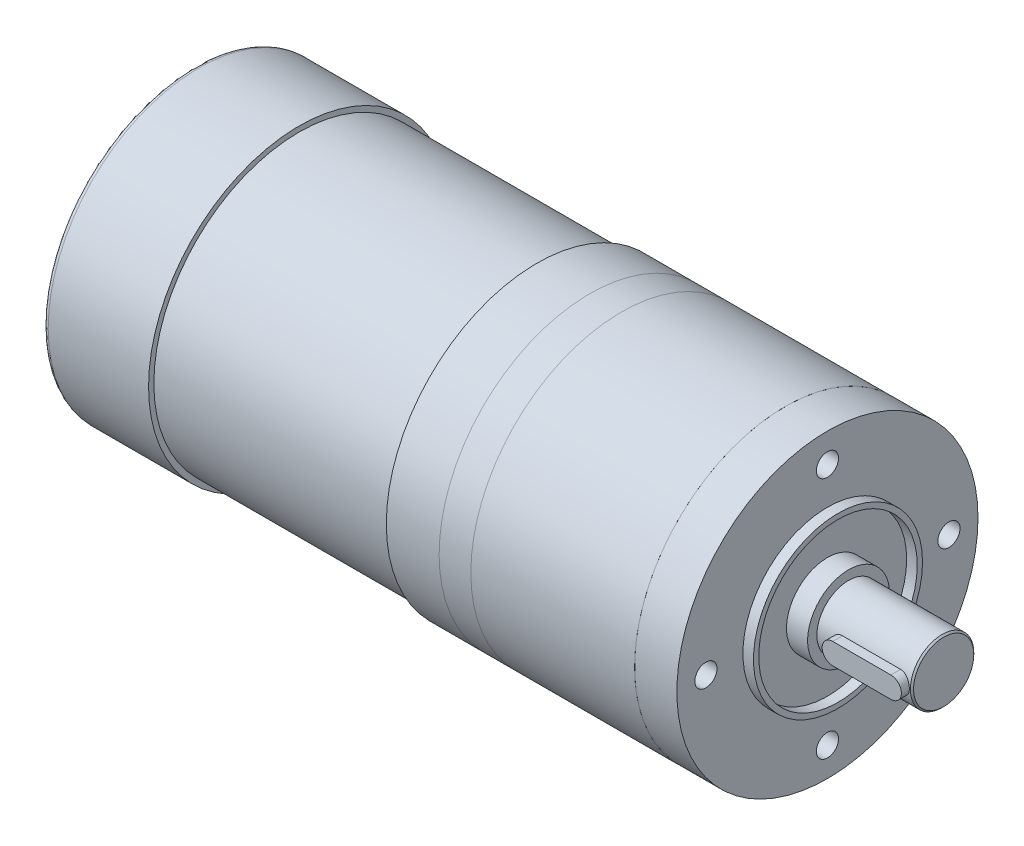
ISO-10303-21;
HEADER;
FILE_DESCRIPTION(('STEP AP214'),'2;1');
FILE_NAME('part.step','',(''),(''),'','','');
FILE_SCHEMA(('AUTOMOTIVE_DESIGN { 1 0 10303 214 1 1 1 1 }'));
ENDSEC;
DATA;
#1=APPLICATION_CONTEXT('core data for automotive mechanical design processes');
#2=APPLICATION_PROTOCOL_DEFINITION('international standard','automotive_design',2000,#1);
#3=PRODUCT_CONTEXT('',#1,'mechanical');
#4=PRODUCT('Part','Part','',(#3));
#5=PRODUCT_RELATED_PRODUCT_CATEGORY('part','',(#4));
#6=PRODUCT_DEFINITION_FORMATION('','',#4);
#7=PRODUCT_DEFINITION_CONTEXT('part definition',#1,'design');
#8=PRODUCT_DEFINITION('design','',#6,#7);
#9=PRODUCT_DEFINITION_SHAPE('','',#8);
#10=(LENGTH_UNIT() NAMED_UNIT(*) SI_UNIT(.MILLI.,.METRE.));
#11=(NAMED_UNIT(*) PLANE_ANGLE_UNIT() SI_UNIT($,.RADIAN.));
#12=(NAMED_UNIT(*) SI_UNIT($,.STERADIAN.) SOLID_ANGLE_UNIT());
#13=UNCERTAINTY_MEASURE_WITH_UNIT(LENGTH_MEASURE(1.E-05),#10,'distance_accuracy_value','');
#14=(GEOMETRIC_REPRESENTATION_CONTEXT(3) GLOBAL_UNCERTAINTY_ASSIGNED_CONTEXT((#13)) GLOBAL_UNIT_ASSIGNED_CONTEXT((#10,
#11,#12)) REPRESENTATION_CONTEXT('',''));
#15=CARTESIAN_POINT('',(0.,0.,0.));
#16=DIRECTION('',(0.,0.,1.));
#17=DIRECTION('',(1.,0.,0.));
#18=AXIS2_PLACEMENT_3D('',#15,#16,#17);
#19=CARTESIAN_POINT('',(8.5,0.,7.5));
#20=DIRECTION('',(0.,0.,-1.));
#21=DIRECTION('',(-1.,0.,0.));
#22=AXIS2_PLACEMENT_3D('',#19,#20,#21);
#23=CYLINDRICAL_SURFACE('',#22,2.);
#24=CARTESIAN_POINT('',(8.5,0.,3.5));
#25=DIRECTION('',(0.,0.,1.));
#26=DIRECTION('',(1.,0.,0.));
#27=AXIS2_PLACEMENT_3D('',#24,#25,#26);
#28=CIRCLE('',#27,2.);
#29=CARTESIAN_POINT('',(8.5,2.,3.5));
#30=VERTEX_POINT('',#29);
#31=CARTESIAN_POINT('',(8.5,-2.,3.5));
#32=VERTEX_POINT('',#31);
#33=EDGE_CURVE('E111',#30,#32,#28,.T.);
#34=ORIENTED_EDGE('',*,*,#33,.T.);
#35=DIRECTION('',(0.,0.,-1.));
#36=VECTOR('',#35,1.);
#37=CARTESIAN_POINT('',(8.5,-2.,7.5));
#38=LINE('',#37,#36);
#39=CARTESIAN_POINT('',(8.5,-2.,7.5));
#40=VERTEX_POINT('',#39);
#41=EDGE_CURVE('E12',#40,#32,#38,.T.);
#42=ORIENTED_EDGE('',*,*,#41,.F.);
#43=CARTESIAN_POINT('',(8.5,0.,7.5));
#44=DIRECTION('',(0.,0.,1.));
#45=DIRECTION('',(1.,0.,0.));
#46=AXIS2_PLACEMENT_3D('',#43,#44,#45);
#47=CIRCLE('',#46,2.);
#48=CARTESIAN_POINT('',(8.5,2.,7.5));
#49=VERTEX_POINT('',#48);
#50=EDGE_CURVE('E99',#49,#40,#47,.T.);
#51=ORIENTED_EDGE('',*,*,#50,.F.);
#52=DIRECTION('',(0.,0.,-1.));
#53=VECTOR('',#52,1.);
#54=CARTESIAN_POINT('',(8.5,2.,7.5));
#55=LINE('',#54,#53);
#56=EDGE_CURVE('E107',#49,#30,#55,.T.);
#57=ORIENTED_EDGE('',*,*,#56,.T.);
#58=EDGE_LOOP('',(#34,#42,#51,#57));
#59=FACE_BOUND('',#58,.T.);
#60=ADVANCED_FACE('F48',(#59),#23,.T.);
#61=CARTESIAN_POINT('',(19.5,-2.,7.5));
#62=DIRECTION('',(0.,1.,0.));
#63=DIRECTION('',(-1.,0.,0.));
#64=AXIS2_PLACEMENT_3D('',#61,#62,#63);
#65=PLANE('',#64);
#66=DIRECTION('',(1.,0.,0.));
#67=VECTOR('',#66,1.);
#68=CARTESIAN_POINT('',(19.5,-2.,3.5));
#69=LINE('',#68,#67);
#70=CARTESIAN_POINT('',(19.5,-2.,3.5));
#71=VERTEX_POINT('',#70);
#72=EDGE_CURVE('E103',#32,#71,#69,.T.);
#73=ORIENTED_EDGE('',*,*,#72,.T.);
#74=DIRECTION('',(0.,0.,-1.));
#75=VECTOR('',#74,1.);
#76=CARTESIAN_POINT('',(19.5,-2.,7.5));
#77=LINE('',#76,#75);
#78=CARTESIAN_POINT('',(19.5,-2.,7.5));
#79=VERTEX_POINT('',#78);
#80=EDGE_CURVE('E56',#79,#71,#77,.T.);
#81=ORIENTED_EDGE('',*,*,#80,.F.);
#82=DIRECTION('',(1.,0.,0.));
#83=VECTOR('',#82,1.);
#84=CARTESIAN_POINT('',(19.5,-2.,7.5));
#85=LINE('',#84,#83);
#86=EDGE_CURVE('E94',#40,#79,#85,.T.);
#87=ORIENTED_EDGE('',*,*,#86,.F.);
#88=ORIENTED_EDGE('',*,*,#41,.T.);
#89=EDGE_LOOP('',(#73,#81,#87,#88));
#90=FACE_BOUND('',#89,.T.);
#91=ADVANCED_FACE('F102',(#90),#65,.F.);
#92=CARTESIAN_POINT('',(19.5,0.,7.5));
#93=DIRECTION('',(0.,0.,-1.));
#94=DIRECTION('',(-1.,0.,0.));
#95=AXIS2_PLACEMENT_3D('',#92,#93,#94);
#96=CYLINDRICAL_SURFACE('',#95,2.);
#97=CARTESIAN_POINT('',(19.5,0.,3.5));
#98=DIRECTION('',(0.,0.,1.));
#99=DIRECTION('',(1.,0.,0.));
#100=AXIS2_PLACEMENT_3D('',#97,#98,#99);
#101=CIRCLE('',#100,2.);
#102=CARTESIAN_POINT('',(19.5,2.,3.5));
#103=VERTEX_POINT('',#102);
#104=EDGE_CURVE('E81',#71,#103,#101,.T.);
#105=ORIENTED_EDGE('',*,*,#104,.T.);
#106=DIRECTION('',(0.,0.,-1.));
#107=VECTOR('',#106,1.);
#108=CARTESIAN_POINT('',(19.5,2.,7.5));
#109=LINE('',#108,#107);
#110=CARTESIAN_POINT('',(19.5,2.,7.5));
#111=VERTEX_POINT('',#110);
#112=EDGE_CURVE('E104',#111,#103,#109,.T.);
#113=ORIENTED_EDGE('',*,*,#112,.F.);
#114=CARTESIAN_POINT('',(19.5,0.,7.5));
#115=DIRECTION('',(0.,0.,1.));
#116=DIRECTION('',(1.,0.,0.));
#117=AXIS2_PLACEMENT_3D('',#114,#115,#116);
#118=CIRCLE('',#117,2.);
#119=EDGE_CURVE('E97',#79,#111,#118,.T.);
#120=ORIENTED_EDGE('',*,*,#119,.F.);
#121=ORIENTED_EDGE('',*,*,#80,.T.);
#122=EDGE_LOOP('',(#105,#113,#120,#121));
#123=FACE_BOUND('',#122,.T.);
#124=ADVANCED_FACE('F105',(#123),#96,.T.);
#125=CARTESIAN_POINT('',(8.5,2.,7.5));
#126=DIRECTION('',(0.,-1.,0.));
#127=DIRECTION('',(1.,0.,0.));
#128=AXIS2_PLACEMENT_3D('',#125,#126,#127);
#129=PLANE('',#128);
#130=DIRECTION('',(-1.,0.,0.));
#131=VECTOR('',#130,1.);
#132=CARTESIAN_POINT('',(8.5,2.,3.5));
#133=LINE('',#132,#131);
#134=EDGE_CURVE('E87',#103,#30,#133,.T.);
#135=ORIENTED_EDGE('',*,*,#134,.T.);
#136=ORIENTED_EDGE('',*,*,#56,.F.);
#137=DIRECTION('',(-1.,0.,0.));
#138=VECTOR('',#137,1.);
#139=CARTESIAN_POINT('',(8.5,2.,7.5));
#140=LINE('',#139,#138);
#141=EDGE_CURVE('E64',#111,#49,#140,.T.);
#142=ORIENTED_EDGE('',*,*,#141,.F.);
#143=ORIENTED_EDGE('',*,*,#112,.T.);
#144=EDGE_LOOP('',(#135,#136,#142,#143));
#145=FACE_BOUND('',#144,.T.);
#146=ADVANCED_FACE('F118',(#145),#129,.F.);
#147=CARTESIAN_POINT('',(8.5,0.,7.5));
#148=DIRECTION('',(0.,0.,1.));
#149=DIRECTION('',(1.,0.,0.));
#150=AXIS2_PLACEMENT_3D('',#147,#148,#149);
#151=PLANE('',#150);
#152=ORIENTED_EDGE('',*,*,#50,.T.);
#153=ORIENTED_EDGE('',*,*,#86,.T.);
#154=ORIENTED_EDGE('',*,*,#119,.T.);
#155=ORIENTED_EDGE('',*,*,#141,.T.);
#156=EDGE_LOOP('',(#152,#153,#154,#155));
#157=FACE_BOUND('',#156,.T.);
#158=ADVANCED_FACE('F95',(#157),#151,.T.);
#159=CARTESIAN_POINT('',(8.5,0.,3.5));
#160=DIRECTION('',(0.,0.,1.));
#161=DIRECTION('',(1.,0.,0.));
#162=AXIS2_PLACEMENT_3D('',#159,#160,#161);
#163=PLANE('',#162);
#164=ORIENTED_EDGE('',*,*,#33,.F.);
#165=ORIENTED_EDGE('',*,*,#134,.F.);
#166=ORIENTED_EDGE('',*,*,#104,.F.);
#167=ORIENTED_EDGE('',*,*,#72,.F.);
#168=EDGE_LOOP('',(#164,#165,#166,#167));
#169=FACE_BOUND('',#168,.T.);
#170=ADVANCED_FACE('F121',(#169),#163,.F.);
#171=CLOSED_SHELL('',(#60,#91,#124,#146,#158,#170));
#172=MANIFOLD_SOLID_BREP('B2',#171);
#173=CARTESIAN_POINT('',(-55.,0.,0.));
#174=DIRECTION('',(-1.,0.,0.));
#175=DIRECTION('',(0.,0.,1.));
#176=AXIS2_PLACEMENT_3D('',#173,#174,#175);
#177=PLANE('',#176);
#178=CARTESIAN_POINT('',(-55.,0.,0.));
#179=DIRECTION('',(-1.,0.,0.));
#180=DIRECTION('',(0.,0.,1.));
#181=AXIS2_PLACEMENT_3D('',#178,#179,#180);
#182=CIRCLE('',#181,28.5);
#183=CARTESIAN_POINT('',(-55.,0.,28.5));
#184=VERTEX_POINT('',#183);
#185=EDGE_CURVE('E191',#184,#184,#182,.T.);
#186=ORIENTED_EDGE('',*,*,#185,.T.);
#187=EDGE_LOOP('',(#186));
#188=FACE_BOUND('',#187,.T.);
#189=CARTESIAN_POINT('',(-55.,0.,0.));
#190=DIRECTION('',(-1.,0.,0.));
#191=DIRECTION('',(0.,0.,1.));
#192=AXIS2_PLACEMENT_3D('',#189,#190,#191);
#193=CIRCLE('',#192,27.5);
#194=CARTESIAN_POINT('',(-55.,0.,-27.5));
#195=VERTEX_POINT('',#194);
#196=EDGE_CURVE('E201',#195,#195,#193,.T.);
#197=ORIENTED_EDGE('',*,*,#196,.F.);
#198=EDGE_LOOP('',(#197));
#199=FACE_BOUND('',#198,.T.);
#200=ADVANCED_FACE('F180',(#188,#199),#177,.T.);
#201=CARTESIAN_POINT('',(-55.,0.,0.));
#202=DIRECTION('',(1.,0.,0.));
#203=DIRECTION('',(0.,0.,-1.));
#204=AXIS2_PLACEMENT_3D('',#201,#202,#203);
#205=CYLINDRICAL_SURFACE('',#204,28.5);
#206=ORIENTED_EDGE('',*,*,#185,.F.);
#207=EDGE_LOOP('',(#206));
#208=FACE_BOUND('',#207,.T.);
#209=CARTESIAN_POINT('',(-45.,0.,0.));
#210=DIRECTION('',(-1.,0.,0.));
#211=DIRECTION('',(0.,0.,1.));
#212=AXIS2_PLACEMENT_3D('',#209,#210,#211);
#213=CIRCLE('',#212,28.5);
#214=CARTESIAN_POINT('',(-45.,0.,28.5));
#215=VERTEX_POINT('',#214);
#216=EDGE_CURVE('E195',#215,#215,#213,.T.);
#217=ORIENTED_EDGE('',*,*,#216,.T.);
#218=EDGE_LOOP('',(#217));
#219=FACE_BOUND('',#218,.T.);
#220=ADVANCED_FACE('F226',(#208,#219),#205,.T.);
#221=CARTESIAN_POINT('',(-45.,0.,0.));
#222=DIRECTION('',(-1.,0.,0.));
#223=DIRECTION('',(0.,0.,1.));
#224=AXIS2_PLACEMENT_3D('',#221,#222,#223);
#225=PLANE('',#224);
#226=ORIENTED_EDGE('',*,*,#216,.F.);
#227=EDGE_LOOP('',(#226));
#228=FACE_BOUND('',#227,.T.);
#229=ADVANCED_FACE('F221',(#228),#225,.F.);
#230=CARTESIAN_POINT('',(-100.,0.,0.));
#231=DIRECTION('',(1.,0.,0.));
#232=DIRECTION('',(0.,0.,-1.));
#233=AXIS2_PLACEMENT_3D('',#230,#231,#232);
#234=CYLINDRICAL_SURFACE('',#233,27.5);
#235=CARTESIAN_POINT('',(-100.,0.,0.));
#236=DIRECTION('',(-1.,0.,0.));
#237=DIRECTION('',(0.,0.,1.));
#238=AXIS2_PLACEMENT_3D('',#235,#236,#237);
#239=CIRCLE('',#238,27.5);
#240=CARTESIAN_POINT('',(-100.,0.,-27.5));
#241=VERTEX_POINT('',#240);
#242=EDGE_CURVE('E199',#241,#241,#239,.T.);
#243=CARTESIAN_POINT('',(-100.,0.,-27.5));
#244=CARTESIAN_POINT('',(-99.53125,0.,-27.5));
#245=CARTESIAN_POINT('',(-99.0625,0.,-27.5));
#246=CARTESIAN_POINT('',(-98.125,0.,-27.5));
#247=CARTESIAN_POINT('',(-97.65625,0.,-27.5));
#248=CARTESIAN_POINT('',(-96.71875,0.,-27.5));
#249=CARTESIAN_POINT('',(-96.25,0.,-27.5));
#250=CARTESIAN_POINT('',(-95.3125,0.,-27.5));
#251=CARTESIAN_POINT('',(-94.84375,0.,-27.5));
#252=CARTESIAN_POINT('',(-93.90625,0.,-27.5));
#253=CARTESIAN_POINT('',(-93.4375,0.,-27.5));
#254=CARTESIAN_POINT('',(-92.5,0.,-27.5));
#255=CARTESIAN_POINT('',(-92.03125,0.,-27.5));
#256=CARTESIAN_POINT('',(-91.09375,0.,-27.5));
#257=CARTESIAN_POINT('',(-90.625,0.,-27.5));
#258=CARTESIAN_POINT('',(-89.6875,0.,-27.5));
#259=CARTESIAN_POINT('',(-89.21875,0.,-27.5));
#260=CARTESIAN_POINT('',(-88.28125,0.,-27.5));
#261=CARTESIAN_POINT('',(-87.8125,0.,-27.5));
#262=CARTESIAN_POINT('',(-86.875,0.,-27.5));
#263=CARTESIAN_POINT('',(-86.40625,0.,-27.5));
#264=CARTESIAN_POINT('',(-85.46875,0.,-27.5));
#265=CARTESIAN_POINT('',(-85.,0.,-27.5));
#266=CARTESIAN_POINT('',(-84.0625,0.,-27.5));
#267=CARTESIAN_POINT('',(-83.59375,0.,-27.5));
#268=CARTESIAN_POINT('',(-82.65625,0.,-27.5));
#269=CARTESIAN_POINT('',(-82.1875,0.,-27.5));
#270=CARTESIAN_POINT('',(-81.25,0.,-27.5));
#271=CARTESIAN_POINT('',(-80.78125,0.,-27.5));
#272=CARTESIAN_POINT('',(-79.84375,0.,-27.5));
#273=CARTESIAN_POINT('',(-79.375,0.,-27.5));
#274=CARTESIAN_POINT('',(-78.4375,0.,-27.5));
#275=CARTESIAN_POINT('',(-77.96875,0.,-27.5));
#276=CARTESIAN_POINT('',(-77.03125,0.,-27.5));
#277=CARTESIAN_POINT('',(-76.5625,0.,-27.5));
#278=CARTESIAN_POINT('',(-75.625,0.,-27.5));
#279=CARTESIAN_POINT('',(-75.15625,0.,-27.5));
#280=CARTESIAN_POINT('',(-74.21875,0.,-27.5));
#281=CARTESIAN_POINT('',(-73.75,0.,-27.5));
#282=CARTESIAN_POINT('',(-72.8125,0.,-27.5));
#283=CARTESIAN_POINT('',(-72.34375,0.,-27.5));
#284=CARTESIAN_POINT('',(-71.40625,0.,-27.5));
#285=CARTESIAN_POINT('',(-70.9375,0.,-27.5));
#286=CARTESIAN_POINT('',(-70.,0.,-27.5));
#287=CARTESIAN_POINT('',(-69.53125,0.,-27.5));
#288=CARTESIAN_POINT('',(-68.59375,0.,-27.5));
#289=CARTESIAN_POINT('',(-68.125,0.,-27.5));
#290=CARTESIAN_POINT('',(-67.1875,0.,-27.5));
#291=CARTESIAN_POINT('',(-66.71875,0.,-27.5));
#292=CARTESIAN_POINT('',(-65.78125,0.,-27.5));
#293=CARTESIAN_POINT('',(-65.3125,0.,-27.5));
#294=CARTESIAN_POINT('',(-64.375,0.,-27.5));
#295=CARTESIAN_POINT('',(-63.90625,0.,-27.5));
#296=CARTESIAN_POINT('',(-62.96875,0.,-27.5));
#297=CARTESIAN_POINT('',(-62.5,0.,-27.5));
#298=CARTESIAN_POINT('',(-61.5625,0.,-27.5));
#299=CARTESIAN_POINT('',(-61.09375,0.,-27.5));
#300=CARTESIAN_POINT('',(-60.15625,0.,-27.5));
#301=CARTESIAN_POINT('',(-59.6875,0.,-27.5));
#302=CARTESIAN_POINT('',(-58.75,0.,-27.5));
#303=CARTESIAN_POINT('',(-58.28125,0.,-27.5));
#304=CARTESIAN_POINT('',(-57.34375,0.,-27.5));
#305=CARTESIAN_POINT('',(-56.875,0.,-27.5));
#306=CARTESIAN_POINT('',(-55.9375,0.,-27.5));
#307=CARTESIAN_POINT('',(-55.46875,0.,-27.5));
#308=CARTESIAN_POINT('',(-55.,0.,-27.5));
#309=B_SPLINE_CURVE_WITH_KNOTS('',3,(#243,#244,#245,#246,#247,#248,#249,#250,#251,#252,#253,
#254,#255,#256,#257,#258,#259,#260,#261,#262,#263,#264,#265,#266,#267,#268,#269,#270,#271,#272,
#273,#274,#275,#276,#277,#278,#279,#280,#281,#282,#283,#284,#285,#286,#287,#288,#289,#290,#291,
#292,#293,#294,#295,#296,#297,#298,#299,#300,#301,#302,#303,#304,#305,#306,#307,#308),
.UNSPECIFIED.,.F.,.F.,(4,2,2,2,2,2,2,2,2,2,2,2,2,2,2,2,2,2,2,2,2,2,2,2,2,2,2,2,2,2,2,2,4),(0.,
1.40625,2.8125,4.21874999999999,5.62499999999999,7.03124999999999,8.43749999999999,9.84375,
11.25,12.65625,14.0625,15.46875,16.875,18.28125,19.6875,21.09375,22.5,23.90625,25.3125,26.71875,
28.125,29.53125,30.9375,32.34375,33.75,35.15625,36.5625,37.96875,39.375,40.78125,42.1875,
43.59375,45.),.UNSPECIFIED.);
#310=EDGE_CURVE('BSEAM215',#241,#195,#309,.T.);
#311=ORIENTED_EDGE('',*,*,#242,.F.);
#312=ORIENTED_EDGE('',*,*,#196,.T.);
#313=ORIENTED_EDGE('',*,*,#310,.T.);
#314=ORIENTED_EDGE('',*,*,#310,.F.);
#315=EDGE_LOOP('',(#311,#313,#312,#314));
#316=FACE_BOUND('',#315,.T.);
#317=ADVANCED_FACE('F215',(#316),#234,.T.);
#318=CARTESIAN_POINT('',(-100.,0.,0.));
#319=DIRECTION('',(-1.,0.,0.));
#320=DIRECTION('',(0.,0.,1.));
#321=AXIS2_PLACEMENT_3D('',#318,#319,#320);
#322=PLANE('',#321);
#323=CARTESIAN_POINT('',(-100.,0.,0.));
#324=DIRECTION('',(-1.,0.,0.));
#325=DIRECTION('',(0.,0.,1.));
#326=AXIS2_PLACEMENT_3D('',#323,#324,#325);
#327=CIRCLE('',#326,28.5);
#328=CARTESIAN_POINT('',(-100.,0.,28.5));
#329=VERTEX_POINT('',#328);
#330=EDGE_CURVE('E204',#329,#329,#327,.T.);
#331=ORIENTED_EDGE('',*,*,#330,.F.);
#332=EDGE_LOOP('',(#331));
#333=FACE_BOUND('',#332,.T.);
#334=ORIENTED_EDGE('',*,*,#242,.T.);
#335=EDGE_LOOP('',(#334));
#336=FACE_BOUND('',#335,.T.);
#337=ADVANCED_FACE('F212',(#333,#336),#322,.F.);
#338=CARTESIAN_POINT('',(-120.,0.,0.));
#339=DIRECTION('',(1.,0.,0.));
#340=DIRECTION('',(0.,0.,-1.));
#341=AXIS2_PLACEMENT_3D('',#338,#339,#340);
#342=CYLINDRICAL_SURFACE('',#341,28.5);
#343=CARTESIAN_POINT('',(-119.,0.,0.));
#344=DIRECTION('',(-1.,0.,0.));
#345=DIRECTION('',(0.,0.,1.));
#346=AXIS2_PLACEMENT_3D('',#343,#344,#345);
#347=CIRCLE('',#346,28.5);
#348=CARTESIAN_POINT('',(-119.,0.,28.5));
#349=VERTEX_POINT('',#348);
#350=EDGE_CURVE('E47',#349,#349,#347,.F.);
#351=ORIENTED_EDGE('',*,*,#350,.T.);
#352=EDGE_LOOP('',(#351));
#353=FACE_BOUND('',#352,.T.);
#354=ORIENTED_EDGE('',*,*,#330,.T.);
#355=EDGE_LOOP('',(#354));
#356=FACE_BOUND('',#355,.T.);
#357=ADVANCED_FACE('F210',(#353,#356),#342,.T.);
#358=CARTESIAN_POINT('',(-120.,0.,0.));
#359=DIRECTION('',(-1.,0.,0.));
#360=DIRECTION('',(0.,0.,1.));
#361=AXIS2_PLACEMENT_3D('',#358,#359,#360);
#362=PLANE('',#361);
#363=CARTESIAN_POINT('',(-120.,0.,0.));
#364=DIRECTION('',(-1.,0.,0.));
#365=DIRECTION('',(0.,0.,1.));
#366=AXIS2_PLACEMENT_3D('',#363,#364,#365);
#367=CIRCLE('',#366,27.5);
#368=CARTESIAN_POINT('',(-120.,0.,27.5));
#369=VERTEX_POINT('',#368);
#370=EDGE_CURVE('E187',#369,#369,#367,.T.);
#371=ORIENTED_EDGE('',*,*,#370,.T.);
#372=EDGE_LOOP('',(#371));
#373=FACE_BOUND('',#372,.T.);
#374=ADVANCED_FACE('F257',(#373),#362,.T.);
#375=CARTESIAN_POINT('',(-119.,0.,0.));
#376=DIRECTION('',(-1.,0.,0.));
#377=DIRECTION('',(0.,0.,1.));
#378=AXIS2_PLACEMENT_3D('',#375,#376,#377);
#379=TOROIDAL_SURFACE('',#378,27.5,1.);
#380=ORIENTED_EDGE('',*,*,#350,.F.);
#381=EDGE_LOOP('',(#380));
#382=FACE_BOUND('',#381,.T.);
#383=ORIENTED_EDGE('',*,*,#370,.F.);
#384=EDGE_LOOP('',(#383));
#385=FACE_BOUND('',#384,.T.);
#386=ADVANCED_FACE('F182',(#382,#385),#379,.T.);
#387=CLOSED_SHELL('',(#200,#220,#229,#317,#337,#357,#374,#386));
#388=MANIFOLD_SOLID_BREP('B6',#387);
#389=CARTESIAN_POINT('',(-45.,0.,0.));
#390=DIRECTION('',(1.,0.,0.));
#391=DIRECTION('',(0.,0.,-1.));
#392=AXIS2_PLACEMENT_3D('',#389,#390,#391);
#393=CYLINDRICAL_SURFACE('',#392,28.5);
#394=CARTESIAN_POINT('',(-45.,0.,0.));
#395=DIRECTION('',(-1.,0.,0.));
#396=DIRECTION('',(0.,0.,1.));
#397=AXIS2_PLACEMENT_3D('',#394,#395,#396);
#398=CIRCLE('',#397,28.5);
#399=CARTESIAN_POINT('',(-45.,0.,28.5));
#400=VERTEX_POINT('',#399);
#401=EDGE_CURVE('E179',#400,#400,#398,.T.);
#402=ORIENTED_EDGE('',*,*,#401,.F.);
#403=EDGE_LOOP('',(#402));
#404=FACE_BOUND('',#403,.T.);
#405=CARTESIAN_POINT('',(-39.,0.,0.));
#406=DIRECTION('',(-1.,0.,0.));
#407=DIRECTION('',(0.,0.,1.));
#408=AXIS2_PLACEMENT_3D('',#405,#406,#407);
#409=CIRCLE('',#408,28.5);
#410=CARTESIAN_POINT('',(-39.,0.,28.5));
#411=VERTEX_POINT('',#410);
#412=EDGE_CURVE('E309',#411,#411,#409,.T.);
#413=ORIENTED_EDGE('',*,*,#412,.T.);
#414=EDGE_LOOP('',(#413));
#415=FACE_BOUND('',#414,.T.);
#416=ADVANCED_FACE('F306',(#404,#415),#393,.T.);
#417=CARTESIAN_POINT('',(-45.,0.,0.));
#418=DIRECTION('',(-1.,0.,0.));
#419=DIRECTION('',(0.,0.,1.));
#420=AXIS2_PLACEMENT_3D('',#417,#418,#419);
#421=PLANE('',#420);
#422=ORIENTED_EDGE('',*,*,#401,.T.);
#423=EDGE_LOOP('',(#422));
#424=FACE_BOUND('',#423,.T.);
#425=ADVANCED_FACE('F321',(#424),#421,.T.);
#426=CARTESIAN_POINT('',(-39.,0.,0.));
#427=DIRECTION('',(-1.,0.,0.));
#428=DIRECTION('',(0.,0.,1.));
#429=AXIS2_PLACEMENT_3D('',#426,#427,#428);
#430=PLANE('',#429);
#431=ORIENTED_EDGE('',*,*,#412,.F.);
#432=EDGE_LOOP('',(#431));
#433=FACE_BOUND('',#432,.T.);
#434=ADVANCED_FACE('F319',(#433),#430,.F.);
#435=CLOSED_SHELL('',(#416,#425,#434));
#436=MANIFOLD_SOLID_BREP('B42',#435);
#437=CARTESIAN_POINT('',(-39.,0.,0.));
#438=DIRECTION('',(1.,0.,0.));
#439=DIRECTION('',(0.,0.,-1.));
#440=AXIS2_PLACEMENT_3D('',#437,#438,#439);
#441=CYLINDRICAL_SURFACE('',#440,28.5);
#442=CARTESIAN_POINT('',(-39.,0.,0.));
#443=DIRECTION('',(-1.,0.,0.));
#444=DIRECTION('',(0.,0.,1.));
#445=AXIS2_PLACEMENT_3D('',#442,#443,#444);
#446=CIRCLE('',#445,28.5);
#447=CARTESIAN_POINT('',(-39.,0.,28.5));
#448=VERTEX_POINT('',#447);
#449=EDGE_CURVE('E304',#448,#448,#446,.T.);
#450=ORIENTED_EDGE('',*,*,#449,.F.);
#451=EDGE_LOOP('',(#450));
#452=FACE_BOUND('',#451,.T.);
#453=CARTESIAN_POINT('',(-8.,0.,0.));
#454=DIRECTION('',(-1.,0.,0.));
#455=DIRECTION('',(0.,0.,1.));
#456=AXIS2_PLACEMENT_3D('',#453,#454,#455);
#457=CIRCLE('',#456,28.5);
#458=CARTESIAN_POINT('',(-8.,0.,28.5));
#459=VERTEX_POINT('',#458);
#460=EDGE_CURVE('E364',#459,#459,#457,.T.);
#461=ORIENTED_EDGE('',*,*,#460,.T.);
#462=EDGE_LOOP('',(#461));
#463=FACE_BOUND('',#462,.T.);
#464=ADVANCED_FACE('F356',(#452,#463),#441,.T.);
#465=CARTESIAN_POINT('',(-39.,0.,0.));
#466=DIRECTION('',(-1.,0.,0.));
#467=DIRECTION('',(0.,0.,1.));
#468=AXIS2_PLACEMENT_3D('',#465,#466,#467);
#469=PLANE('',#468);
#470=ORIENTED_EDGE('',*,*,#449,.T.);
#471=EDGE_LOOP('',(#470));
#472=FACE_BOUND('',#471,.T.);
#473=ADVANCED_FACE('F429',(#472),#469,.T.);
#474=CARTESIAN_POINT('',(-8.,0.,0.));
#475=DIRECTION('',(-1.,0.,0.));
#476=DIRECTION('',(0.,0.,1.));
#477=AXIS2_PLACEMENT_3D('',#474,#475,#476);
#478=PLANE('',#477);
#479=CARTESIAN_POINT('',(-8.,23.,0.));
#480=DIRECTION('',(-1.,0.,0.));
#481=DIRECTION('',(0.,0.,1.));
#482=AXIS2_PLACEMENT_3D('',#479,#480,#481);
#483=CIRCLE('',#482,2.1);
#484=CARTESIAN_POINT('',(-8.,23.,2.1));
#485=VERTEX_POINT('',#484);
#486=EDGE_CURVE('E359',#485,#485,#483,.T.);
#487=ORIENTED_EDGE('',*,*,#486,.T.);
#488=EDGE_LOOP('',(#487));
#489=FACE_BOUND('',#488,.T.);
#490=CARTESIAN_POINT('',(-8.,0.,-23.));
#491=DIRECTION('',(-1.,0.,0.));
#492=DIRECTION('',(0.,0.,1.));
#493=AXIS2_PLACEMENT_3D('',#490,#491,#492);
#494=CIRCLE('',#493,2.1);
#495=CARTESIAN_POINT('',(-8.,0.,-20.9));
#496=VERTEX_POINT('',#495);
#497=EDGE_CURVE('E393',#496,#496,#494,.T.);
#498=ORIENTED_EDGE('',*,*,#497,.T.);
#499=EDGE_LOOP('',(#498));
#500=FACE_BOUND('',#499,.T.);
#501=CARTESIAN_POINT('',(-8.,-23.,0.));
#502=DIRECTION('',(-1.,0.,0.));
#503=DIRECTION('',(0.,0.,1.));
#504=AXIS2_PLACEMENT_3D('',#501,#502,#503);
#505=CIRCLE('',#504,2.1);
#506=CARTESIAN_POINT('',(-8.,-23.,2.1));
#507=VERTEX_POINT('',#506);
#508=EDGE_CURVE('E397',#507,#507,#505,.T.);
#509=ORIENTED_EDGE('',*,*,#508,.T.);
#510=EDGE_LOOP('',(#509));
#511=FACE_BOUND('',#510,.T.);
#512=CARTESIAN_POINT('',(-8.,0.,23.));
#513=DIRECTION('',(-1.,0.,0.));
#514=DIRECTION('',(0.,0.,1.));
#515=AXIS2_PLACEMENT_3D('',#512,#513,#514);
#516=CIRCLE('',#515,2.1);
#517=CARTESIAN_POINT('',(-8.,0.,25.1));
#518=VERTEX_POINT('',#517);
#519=EDGE_CURVE('E400',#518,#518,#516,.T.);
#520=ORIENTED_EDGE('',*,*,#519,.T.);
#521=EDGE_LOOP('',(#520));
#522=FACE_BOUND('',#521,.T.);
#523=ORIENTED_EDGE('',*,*,#460,.F.);
#524=EDGE_LOOP('',(#523));
#525=FACE_BOUND('',#524,.T.);
#526=ADVANCED_FACE('F410',(#489,#500,#511,#522,#525),#478,.F.);
#527=CARTESIAN_POINT('',(0.,0.,23.));
#528=DIRECTION('',(1.,0.,0.));
#529=DIRECTION('',(0.,0.,-1.));
#530=AXIS2_PLACEMENT_3D('',#527,#528,#529);
#531=CYLINDRICAL_SURFACE('',#530,2.1);
#532=CARTESIAN_POINT('',(-14.,0.,23.));
#533=DIRECTION('',(1.,0.,0.));
#534=DIRECTION('',(0.,0.,-1.));
#535=AXIS2_PLACEMENT_3D('',#532,#533,#534);
#536=CIRCLE('',#535,2.1);
#537=CARTESIAN_POINT('',(-14.,0.,20.9));
#538=VERTEX_POINT('',#537);
#539=EDGE_CURVE('E398',#538,#538,#536,.T.);
#540=ORIENTED_EDGE('',*,*,#539,.F.);
#541=EDGE_LOOP('',(#540));
#542=FACE_BOUND('',#541,.T.);
#543=ORIENTED_EDGE('',*,*,#519,.F.);
#544=EDGE_LOOP('',(#543));
#545=FACE_BOUND('',#544,.T.);
#546=ADVANCED_FACE('F441',(#542,#545),#531,.F.);
#547=CARTESIAN_POINT('',(-14.,0.,23.));
#548=DIRECTION('',(1.,0.,0.));
#549=DIRECTION('',(0.,0.,-1.));
#550=AXIS2_PLACEMENT_3D('',#547,#548,#549);
#551=CONICAL_SURFACE('',#550,2.1,1.02974425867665);
#552=CARTESIAN_POINT('',(-15.2618072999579,0.,23.));
#553=VERTEX_POINT('',#552);
#554=VERTEX_LOOP('',#553);
#555=FACE_BOUND('',#554,.T.);
#556=ORIENTED_EDGE('',*,*,#539,.T.);
#557=EDGE_LOOP('',(#556));
#558=FACE_BOUND('',#557,.T.);
#559=ADVANCED_FACE('F446',(#555,#558),#551,.F.);
#560=CARTESIAN_POINT('',(0.,-23.,0.));
#561=DIRECTION('',(1.,0.,0.));
#562=DIRECTION('',(0.,0.,-1.));
#563=AXIS2_PLACEMENT_3D('',#560,#561,#562);
#564=CYLINDRICAL_SURFACE('',#563,2.1);
#565=CARTESIAN_POINT('',(-14.,-23.,0.));
#566=DIRECTION('',(1.,0.,0.));
#567=DIRECTION('',(0.,0.,-1.));
#568=AXIS2_PLACEMENT_3D('',#565,#566,#567);
#569=CIRCLE('',#568,2.1);
#570=CARTESIAN_POINT('',(-14.,-23.,-2.1));
#571=VERTEX_POINT('',#570);
#572=EDGE_CURVE('E394',#571,#571,#569,.T.);
#573=ORIENTED_EDGE('',*,*,#572,.F.);
#574=EDGE_LOOP('',(#573));
#575=FACE_BOUND('',#574,.T.);
#576=ORIENTED_EDGE('',*,*,#508,.F.);
#577=EDGE_LOOP('',(#576));
#578=FACE_BOUND('',#577,.T.);
#579=ADVANCED_FACE('F425',(#575,#578),#564,.F.);
#580=CARTESIAN_POINT('',(-14.,-23.,0.));
#581=DIRECTION('',(1.,0.,0.));
#582=DIRECTION('',(0.,0.,-1.));
#583=AXIS2_PLACEMENT_3D('',#580,#581,#582);
#584=CONICAL_SURFACE('',#583,2.1,1.02974425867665);
#585=CARTESIAN_POINT('',(-15.2618072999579,-23.,0.));
#586=VERTEX_POINT('',#585);
#587=VERTEX_LOOP('',#586);
#588=FACE_BOUND('',#587,.T.);
#589=ORIENTED_EDGE('',*,*,#572,.T.);
#590=EDGE_LOOP('',(#589));
#591=FACE_BOUND('',#590,.T.);
#592=ADVANCED_FACE('F416',(#588,#591),#584,.F.);
#593=CARTESIAN_POINT('',(0.,0.,-23.));
#594=DIRECTION('',(1.,0.,0.));
#595=DIRECTION('',(0.,0.,-1.));
#596=AXIS2_PLACEMENT_3D('',#593,#594,#595);
#597=CYLINDRICAL_SURFACE('',#596,2.1);
#598=CARTESIAN_POINT('',(-14.,0.,-23.));
#599=DIRECTION('',(1.,0.,0.));
#600=DIRECTION('',(0.,0.,-1.));
#601=AXIS2_PLACEMENT_3D('',#598,#599,#600);
#602=CIRCLE('',#601,2.1);
#603=CARTESIAN_POINT('',(-14.,0.,-25.1));
#604=VERTEX_POINT('',#603);
#605=EDGE_CURVE('E389',#604,#604,#602,.T.);
#606=ORIENTED_EDGE('',*,*,#605,.F.);
#607=EDGE_LOOP('',(#606));
#608=FACE_BOUND('',#607,.T.);
#609=ORIENTED_EDGE('',*,*,#497,.F.);
#610=EDGE_LOOP('',(#609));
#611=FACE_BOUND('',#610,.T.);
#612=ADVANCED_FACE('F413',(#608,#611),#597,.F.);
#613=CARTESIAN_POINT('',(-14.,0.,-23.));
#614=DIRECTION('',(1.,0.,0.));
#615=DIRECTION('',(0.,0.,-1.));
#616=AXIS2_PLACEMENT_3D('',#613,#614,#615);
#617=CONICAL_SURFACE('',#616,2.1,1.02974425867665);
#618=CARTESIAN_POINT('',(-15.2618072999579,0.,-23.));
#619=VERTEX_POINT('',#618);
#620=VERTEX_LOOP('',#619);
#621=FACE_BOUND('',#620,.T.);
#622=ORIENTED_EDGE('',*,*,#605,.T.);
#623=EDGE_LOOP('',(#622));
#624=FACE_BOUND('',#623,.T.);
#625=ADVANCED_FACE('F415',(#621,#624),#617,.F.);
#626=CARTESIAN_POINT('',(0.,23.,0.));
#627=DIRECTION('',(1.,0.,0.));
#628=DIRECTION('',(0.,0.,-1.));
#629=AXIS2_PLACEMENT_3D('',#626,#627,#628);
#630=CYLINDRICAL_SURFACE('',#629,2.1);
#631=CARTESIAN_POINT('',(-14.,23.,0.));
#632=DIRECTION('',(1.,0.,0.));
#633=DIRECTION('',(0.,0.,-1.));
#634=AXIS2_PLACEMENT_3D('',#631,#632,#633);
#635=CIRCLE('',#634,2.1);
#636=CARTESIAN_POINT('',(-14.,23.,-2.1));
#637=VERTEX_POINT('',#636);
#638=EDGE_CURVE('E385',#637,#637,#635,.T.);
#639=ORIENTED_EDGE('',*,*,#638,.F.);
#640=EDGE_LOOP('',(#639));
#641=FACE_BOUND('',#640,.T.);
#642=ORIENTED_EDGE('',*,*,#486,.F.);
#643=EDGE_LOOP('',(#642));
#644=FACE_BOUND('',#643,.T.);
#645=ADVANCED_FACE('F381',(#641,#644),#630,.F.);
#646=CARTESIAN_POINT('',(-14.,23.,0.));
#647=DIRECTION('',(1.,0.,0.));
#648=DIRECTION('',(0.,0.,-1.));
#649=AXIS2_PLACEMENT_3D('',#646,#647,#648);
#650=CONICAL_SURFACE('',#649,2.1,1.02974425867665);
#651=CARTESIAN_POINT('',(-15.2618072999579,23.,0.));
#652=VERTEX_POINT('',#651);
#653=VERTEX_LOOP('',#652);
#654=FACE_BOUND('',#653,.T.);
#655=ORIENTED_EDGE('',*,*,#638,.T.);
#656=EDGE_LOOP('',(#655));
#657=FACE_BOUND('',#656,.T.);
#658=ADVANCED_FACE('F378',(#654,#657),#650,.F.);
#659=CLOSED_SHELL('',(#464,#473,#526,#546,#559,#579,#592,#612,#625,#645,#658));
#660=MANIFOLD_SOLID_BREP('B174',#659);
#661=CARTESIAN_POINT('',(4.,0.,0.));
#662=DIRECTION('',(1.,0.,0.));
#663=DIRECTION('',(0.,0.,-1.));
#664=AXIS2_PLACEMENT_3D('',#661,#662,#663);
#665=PLANE('',#664);
#666=CARTESIAN_POINT('',(4.,0.,0.));
#667=DIRECTION('',(1.,0.,0.));
#668=DIRECTION('',(0.,0.,-1.));
#669=AXIS2_PLACEMENT_3D('',#666,#667,#668);
#670=CIRCLE('',#669,7.75);
#671=CARTESIAN_POINT('',(4.,0.,-7.75));
#672=VERTEX_POINT('',#671);
#673=EDGE_CURVE('E638',#672,#672,#670,.T.);
#674=ORIENTED_EDGE('',*,*,#673,.T.);
#675=EDGE_LOOP('',(#674));
#676=FACE_BOUND('',#675,.T.);
#677=CARTESIAN_POINT('',(4.,0.,0.));
#678=DIRECTION('',(1.,0.,0.));
#679=DIRECTION('',(0.,0.,-1.));
#680=AXIS2_PLACEMENT_3D('',#677,#678,#679);
#681=CIRCLE('',#680,6.);
#682=CARTESIAN_POINT('',(4.,0.,-6.));
#683=VERTEX_POINT('',#682);
#684=EDGE_CURVE('E634',#683,#683,#681,.T.);
#685=ORIENTED_EDGE('',*,*,#684,.F.);
#686=EDGE_LOOP('',(#685));
#687=FACE_BOUND('',#686,.T.);
#688=ADVANCED_FACE('F547',(#676,#687),#665,.T.);
#689=CARTESIAN_POINT('',(0.,0.,0.));
#690=DIRECTION('',(1.,0.,0.));
#691=DIRECTION('',(0.,0.,-1.));
#692=AXIS2_PLACEMENT_3D('',#689,#690,#691);
#693=PLANE('',#692);
#694=CARTESIAN_POINT('',(0.,0.,0.));
#695=DIRECTION('',(1.,0.,0.));
#696=DIRECTION('',(0.,0.,-1.));
#697=AXIS2_PLACEMENT_3D('',#694,#695,#696);
#698=CIRCLE('',#697,15.);
#699=CARTESIAN_POINT('',(0.,0.,-15.));
#700=VERTEX_POINT('',#699);
#701=EDGE_CURVE('E656',#700,#700,#698,.F.);
#702=ORIENTED_EDGE('',*,*,#701,.F.);
#703=EDGE_LOOP('',(#702));
#704=FACE_BOUND('',#703,.T.);
#705=CARTESIAN_POINT('',(0.,0.,0.));
#706=DIRECTION('',(1.,0.,0.));
#707=DIRECTION('',(0.,0.,-1.));
#708=AXIS2_PLACEMENT_3D('',#705,#706,#707);
#709=CIRCLE('',#708,7.75);
#710=CARTESIAN_POINT('',(0.,0.,-7.75));
#711=VERTEX_POINT('',#710);
#712=EDGE_CURVE('E637',#711,#711,#709,.T.);
#713=ORIENTED_EDGE('',*,*,#712,.F.);
#714=EDGE_LOOP('',(#713));
#715=FACE_BOUND('',#714,.T.);
#716=ADVANCED_FACE('F723',(#704,#715),#693,.T.);
#717=CARTESIAN_POINT('',(0.,23.,0.));
#718=DIRECTION('',(1.,0.,0.));
#719=DIRECTION('',(0.,0.,-1.));
#720=AXIS2_PLACEMENT_3D('',#717,#718,#719);
#721=CIRCLE('',#720,2.1);
#722=CARTESIAN_POINT('',(0.,23.,-2.1));
#723=VERTEX_POINT('',#722);
#724=EDGE_CURVE('E615',#723,#723,#721,.T.);
#725=ORIENTED_EDGE('',*,*,#724,.F.);
#726=EDGE_LOOP('',(#725));
#727=FACE_BOUND('',#726,.T.);
#728=CARTESIAN_POINT('',(0.,0.,-23.));
#729=DIRECTION('',(1.,0.,0.));
#730=DIRECTION('',(0.,0.,-1.));
#731=AXIS2_PLACEMENT_3D('',#728,#729,#730);
#732=CIRCLE('',#731,2.1);
#733=CARTESIAN_POINT('',(0.,0.,-25.1));
#734=VERTEX_POINT('',#733);
#735=EDGE_CURVE('E622',#734,#734,#732,.T.);
#736=ORIENTED_EDGE('',*,*,#735,.F.);
#737=EDGE_LOOP('',(#736));
#738=FACE_BOUND('',#737,.T.);
#739=CARTESIAN_POINT('',(0.,-23.,0.));
#740=DIRECTION('',(1.,0.,0.));
#741=DIRECTION('',(0.,0.,-1.));
#742=AXIS2_PLACEMENT_3D('',#739,#740,#741);
#743=CIRCLE('',#742,2.1);
#744=CARTESIAN_POINT('',(0.,-23.,-2.1));
#745=VERTEX_POINT('',#744);
#746=EDGE_CURVE('E626',#745,#745,#743,.T.);
#747=ORIENTED_EDGE('',*,*,#746,.F.);
#748=EDGE_LOOP('',(#747));
#749=FACE_BOUND('',#748,.T.);
#750=CARTESIAN_POINT('',(0.,0.,23.));
#751=DIRECTION('',(1.,0.,0.));
#752=DIRECTION('',(0.,0.,-1.));
#753=AXIS2_PLACEMENT_3D('',#750,#751,#752);
#754=CIRCLE('',#753,2.1);
#755=CARTESIAN_POINT('',(0.,0.,20.9));
#756=VERTEX_POINT('',#755);
#757=EDGE_CURVE('E630',#756,#756,#754,.T.);
#758=ORIENTED_EDGE('',*,*,#757,.F.);
#759=EDGE_LOOP('',(#758));
#760=FACE_BOUND('',#759,.T.);
#761=CARTESIAN_POINT('',(0.,0.,0.));
#762=DIRECTION('',(1.,0.,0.));
#763=DIRECTION('',(0.,0.,-1.));
#764=AXIS2_PLACEMENT_3D('',#761,#762,#763);
#765=CIRCLE('',#764,28.5);
#766=CARTESIAN_POINT('',(0.,0.,-28.5));
#767=VERTEX_POINT('',#766);
#768=EDGE_CURVE('E650',#767,#767,#765,.T.);
#769=ORIENTED_EDGE('',*,*,#768,.T.);
#770=EDGE_LOOP('',(#769));
#771=FACE_BOUND('',#770,.T.);
#772=CARTESIAN_POINT('',(0.,0.,0.));
#773=DIRECTION('',(1.,0.,0.));
#774=DIRECTION('',(0.,0.,-1.));
#775=AXIS2_PLACEMENT_3D('',#772,#773,#774);
#776=CIRCLE('',#775,16.);
#777=CARTESIAN_POINT('',(0.,0.,-16.));
#778=VERTEX_POINT('',#777);
#779=EDGE_CURVE('E646',#778,#778,#776,.T.);
#780=ORIENTED_EDGE('',*,*,#779,.F.);
#781=EDGE_LOOP('',(#780));
#782=FACE_BOUND('',#781,.T.);
#783=ADVANCED_FACE('F728',(#727,#738,#749,#760,#771,#782),#693,.T.);
#784=CARTESIAN_POINT('',(-8.,0.,0.));
#785=DIRECTION('',(1.,0.,0.));
#786=DIRECTION('',(0.,0.,-1.));
#787=AXIS2_PLACEMENT_3D('',#784,#785,#786);
#788=CYLINDRICAL_SURFACE('',#787,28.5);
#789=CARTESIAN_POINT('',(-8.,0.,0.));
#790=DIRECTION('',(1.,0.,0.));
#791=DIRECTION('',(0.,0.,-1.));
#792=AXIS2_PLACEMENT_3D('',#789,#790,#791);
#793=CIRCLE('',#792,28.5);
#794=CARTESIAN_POINT('',(-8.,0.,-28.5));
#795=VERTEX_POINT('',#794);
#796=EDGE_CURVE('E653',#795,#795,#793,.T.);
#797=ORIENTED_EDGE('',*,*,#796,.T.);
#798=EDGE_LOOP('',(#797));
#799=FACE_BOUND('',#798,.T.);
#800=ORIENTED_EDGE('',*,*,#768,.F.);
#801=EDGE_LOOP('',(#800));
#802=FACE_BOUND('',#801,.T.);
#803=ADVANCED_FACE('F750',(#799,#802),#788,.T.);
#804=CARTESIAN_POINT('',(-8.,0.,0.));
#805=DIRECTION('',(1.,0.,0.));
#806=DIRECTION('',(0.,0.,-1.));
#807=AXIS2_PLACEMENT_3D('',#804,#805,#806);
#808=PLANE('',#807);
#809=CARTESIAN_POINT('',(-8.,23.,0.));
#810=DIRECTION('',(1.,0.,0.));
#811=DIRECTION('',(0.,0.,-1.));
#812=AXIS2_PLACEMENT_3D('',#809,#810,#811);
#813=CIRCLE('',#812,2.1);
#814=CARTESIAN_POINT('',(-8.,23.,-2.1));
#815=VERTEX_POINT('',#814);
#816=EDGE_CURVE('E621',#815,#815,#813,.T.);
#817=ORIENTED_EDGE('',*,*,#816,.T.);
#818=EDGE_LOOP('',(#817));
#819=FACE_BOUND('',#818,.T.);
#820=CARTESIAN_POINT('',(-8.,0.,-23.));
#821=DIRECTION('',(1.,0.,0.));
#822=DIRECTION('',(0.,0.,-1.));
#823=AXIS2_PLACEMENT_3D('',#820,#821,#822);
#824=CIRCLE('',#823,2.1);
#825=CARTESIAN_POINT('',(-8.,0.,-25.1));
#826=VERTEX_POINT('',#825);
#827=EDGE_CURVE('E625',#826,#826,#824,.T.);
#828=ORIENTED_EDGE('',*,*,#827,.T.);
#829=EDGE_LOOP('',(#828));
#830=FACE_BOUND('',#829,.T.);
#831=CARTESIAN_POINT('',(-8.,-23.,0.));
#832=DIRECTION('',(1.,0.,0.));
#833=DIRECTION('',(0.,0.,-1.));
#834=AXIS2_PLACEMENT_3D('',#831,#832,#833);
#835=CIRCLE('',#834,2.1);
#836=CARTESIAN_POINT('',(-8.,-23.,-2.1));
#837=VERTEX_POINT('',#836);
#838=EDGE_CURVE('E629',#837,#837,#835,.T.);
#839=ORIENTED_EDGE('',*,*,#838,.T.);
#840=EDGE_LOOP('',(#839));
#841=FACE_BOUND('',#840,.T.);
#842=CARTESIAN_POINT('',(-8.,0.,23.));
#843=DIRECTION('',(1.,0.,0.));
#844=DIRECTION('',(0.,0.,-1.));
#845=AXIS2_PLACEMENT_3D('',#842,#843,#844);
#846=CIRCLE('',#845,2.1);
#847=CARTESIAN_POINT('',(-8.,0.,20.9));
#848=VERTEX_POINT('',#847);
#849=EDGE_CURVE('E633',#848,#848,#846,.T.);
#850=ORIENTED_EDGE('',*,*,#849,.T.);
#851=EDGE_LOOP('',(#850));
#852=FACE_BOUND('',#851,.T.);
#853=ORIENTED_EDGE('',*,*,#796,.F.);
#854=EDGE_LOOP('',(#853));
#855=FACE_BOUND('',#854,.T.);
#856=ADVANCED_FACE('F744',(#819,#830,#841,#852,#855),#808,.F.);
#857=CARTESIAN_POINT('',(2.,0.,0.));
#858=DIRECTION('',(1.,0.,0.));
#859=DIRECTION('',(0.,0.,-1.));
#860=AXIS2_PLACEMENT_3D('',#857,#858,#859);
#861=PLANE('',#860);
#862=CARTESIAN_POINT('',(2.,0.,0.));
#863=DIRECTION('',(1.,0.,0.));
#864=DIRECTION('',(0.,0.,-1.));
#865=AXIS2_PLACEMENT_3D('',#862,#863,#864);
#866=CIRCLE('',#865,16.);
#867=CARTESIAN_POINT('',(2.,0.,-16.));
#868=VERTEX_POINT('',#867);
#869=EDGE_CURVE('E647',#868,#868,#866,.T.);
#870=ORIENTED_EDGE('',*,*,#869,.T.);
#871=EDGE_LOOP('',(#870));
#872=FACE_BOUND('',#871,.T.);
#873=CARTESIAN_POINT('',(2.,0.,0.));
#874=DIRECTION('',(1.,0.,0.));
#875=DIRECTION('',(0.,0.,-1.));
#876=AXIS2_PLACEMENT_3D('',#873,#874,#875);
#877=CIRCLE('',#876,15.);
#878=CARTESIAN_POINT('',(2.,0.,-15.));
#879=VERTEX_POINT('',#878);
#880=EDGE_CURVE('E641',#879,#879,#877,.T.);
#881=ORIENTED_EDGE('',*,*,#880,.F.);
#882=EDGE_LOOP('',(#881));
#883=FACE_BOUND('',#882,.T.);
#884=ADVANCED_FACE('F741',(#872,#883),#861,.T.);
#885=CARTESIAN_POINT('',(2.,0.,0.));
#886=DIRECTION('',(-1.,0.,0.));
#887=DIRECTION('',(0.,0.,1.));
#888=AXIS2_PLACEMENT_3D('',#885,#886,#887);
#889=CYLINDRICAL_SURFACE('',#888,16.);
#890=ORIENTED_EDGE('',*,*,#869,.F.);
#891=EDGE_LOOP('',(#890));
#892=FACE_BOUND('',#891,.T.);
#893=ORIENTED_EDGE('',*,*,#779,.T.);
#894=EDGE_LOOP('',(#893));
#895=FACE_BOUND('',#894,.T.);
#896=ADVANCED_FACE('F739',(#892,#895),#889,.T.);
#897=CARTESIAN_POINT('',(2.,0.,0.));
#898=DIRECTION('',(-1.,0.,0.));
#899=DIRECTION('',(0.,0.,1.));
#900=AXIS2_PLACEMENT_3D('',#897,#898,#899);
#901=CYLINDRICAL_SURFACE('',#900,15.);
#902=ORIENTED_EDGE('',*,*,#880,.T.);
#903=EDGE_LOOP('',(#902));
#904=FACE_BOUND('',#903,.T.);
#905=ORIENTED_EDGE('',*,*,#701,.T.);
#906=EDGE_LOOP('',(#905));
#907=FACE_BOUND('',#906,.T.);
#908=ADVANCED_FACE('F735',(#904,#907),#901,.F.);
#909=CARTESIAN_POINT('',(4.,0.,0.));
#910=DIRECTION('',(-1.,0.,0.));
#911=DIRECTION('',(0.,0.,1.));
#912=AXIS2_PLACEMENT_3D('',#909,#910,#911);
#913=CYLINDRICAL_SURFACE('',#912,7.75);
#914=ORIENTED_EDGE('',*,*,#673,.F.);
#915=EDGE_LOOP('',(#914));
#916=FACE_BOUND('',#915,.T.);
#917=ORIENTED_EDGE('',*,*,#712,.T.);
#918=EDGE_LOOP('',(#917));
#919=FACE_BOUND('',#918,.T.);
#920=ADVANCED_FACE('F719',(#916,#919),#913,.T.);
#921=CARTESIAN_POINT('',(22.,0.,0.));
#922=DIRECTION('',(-1.,0.,0.));
#923=DIRECTION('',(0.,0.,1.));
#924=AXIS2_PLACEMENT_3D('',#921,#922,#923);
#925=CYLINDRICAL_SURFACE('',#924,6.);
#926=CARTESIAN_POINT('',(21.7,0.,0.));
#927=DIRECTION('',(1.,0.,0.));
#928=DIRECTION('',(0.,0.,-1.));
#929=AXIS2_PLACEMENT_3D('',#926,#927,#928);
#930=CIRCLE('',#929,6.);
#931=CARTESIAN_POINT('',(21.7,0.,-6.));
#932=VERTEX_POINT('',#931);
#933=EDGE_CURVE('E354',#932,#932,#930,.F.);
#934=ORIENTED_EDGE('',*,*,#933,.T.);
#935=EDGE_LOOP('',(#934));
#936=FACE_BOUND('',#935,.T.);
#937=DIRECTION('',(-1.,0.,0.));
#938=VECTOR('',#937,1.);
#939=CARTESIAN_POINT('',(22.,2.,5.65685424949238));
#940=LINE('',#939,#938);
#941=CARTESIAN_POINT('',(8.5,2.,5.65685424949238));
#942=VERTEX_POINT('',#941);
#943=CARTESIAN_POINT('',(19.5,2.,5.65685424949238));
#944=VERTEX_POINT('',#943);
#945=EDGE_CURVE('E570',#942,#944,#940,.F.);
#946=ORIENTED_EDGE('',*,*,#945,.T.);
#947=CARTESIAN_POINT('',(19.5,2.,5.65685424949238));
#948=CARTESIAN_POINT('',(19.5545809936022,2.00000149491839,5.65684884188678));
#949=CARTESIAN_POINT('',(19.6091341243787,1.99776424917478,5.6576451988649));
#950=CARTESIAN_POINT('',(19.7178171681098,1.9888512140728,5.66078654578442));
#951=CARTESIAN_POINT('',(19.7719471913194,1.98217662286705,5.66313111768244));
#952=CARTESIAN_POINT('',(19.9327842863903,1.95562135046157,5.67238184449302));
#953=CARTESIAN_POINT('',(20.038361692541,1.92920846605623,5.6815058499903));
#954=CARTESIAN_POINT('',(20.2432503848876,1.85991682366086,5.70456149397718));
#955=CARTESIAN_POINT('',(20.3425650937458,1.81704715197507,5.71849047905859));
#956=CARTESIAN_POINT('',(20.5326796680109,1.71614645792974,5.74957574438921));
#957=CARTESIAN_POINT('',(20.6234742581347,1.65810612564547,5.76673400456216));
#958=CARTESIAN_POINT('',(20.7974404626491,1.52610278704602,5.80308960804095));
#959=CARTESIAN_POINT('',(20.8802297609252,1.45164996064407,5.82233755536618));
#960=CARTESIAN_POINT('',(21.0324120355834,1.28997688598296,5.86027697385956));
#961=CARTESIAN_POINT('',(21.1018026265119,1.20275436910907,5.87896834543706));
#962=CARTESIAN_POINT('',(21.2269590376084,1.01520729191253,5.91427765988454));
#963=CARTESIAN_POINT('',(21.2823219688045,0.914600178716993,5.93082875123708));
#964=CARTESIAN_POINT('',(21.3751845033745,0.704858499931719,5.95939217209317));
#965=CARTESIAN_POINT('',(21.4126895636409,0.595726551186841,5.97140588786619));
#966=CARTESIAN_POINT('',(21.4674714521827,0.376058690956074,5.98918142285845));
#967=CARTESIAN_POINT('',(21.4854065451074,0.265703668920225,5.99514617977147));
#968=CARTESIAN_POINT('',(21.5026325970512,0.0433979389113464,6.00087216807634));
#969=CARTESIAN_POINT('',(21.5019279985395,-0.0685523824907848,6.00063487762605));
#970=CARTESIAN_POINT('',(21.4823114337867,-0.286207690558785,5.99412077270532));
#971=CARTESIAN_POINT('',(21.4641147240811,-0.391985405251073,5.98808121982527));
#972=CARTESIAN_POINT('',(21.4112136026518,-0.598888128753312,5.97093921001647));
#973=CARTESIAN_POINT('',(21.3765082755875,-0.700012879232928,5.95983647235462));
#974=CARTESIAN_POINT('',(21.2911572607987,-0.896305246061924,5.93351336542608));
#975=CARTESIAN_POINT('',(21.2403079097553,-0.991377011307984,5.91824075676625));
#976=CARTESIAN_POINT('',(21.1242800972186,-1.17184917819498,5.88516775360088));
#977=CARTESIAN_POINT('',(21.059097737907,-1.25724693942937,5.86736667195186));
#978=CARTESIAN_POINT('',(20.9126579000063,-1.42019467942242,5.83012543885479));
#979=CARTESIAN_POINT('',(20.8307889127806,-1.4971872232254,5.81064757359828));
#980=CARTESIAN_POINT('',(20.6551170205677,-1.63654404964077,5.77294980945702));
#981=CARTESIAN_POINT('',(20.5613102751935,-1.69890360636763,5.75473031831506));
#982=CARTESIAN_POINT('',(20.3626396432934,-1.80800665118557,5.72140062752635));
#983=CARTESIAN_POINT('',(20.2576329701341,-1.85450601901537,5.70634029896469));
#984=CARTESIAN_POINT('',(20.0407060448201,-1.92892046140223,5.68162194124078));
#985=CARTESIAN_POINT('',(19.9287970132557,-1.95686487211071,5.67195538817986));
#986=CARTESIAN_POINT('',(19.763162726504,-1.98331631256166,5.6627308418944));
#987=CARTESIAN_POINT('',(19.7107172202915,-1.98957012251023,5.66053335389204));
#988=CARTESIAN_POINT('',(19.6055238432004,-1.99790923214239,5.65759407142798));
#989=CARTESIAN_POINT('',(19.5527764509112,-1.99999991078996,5.65685039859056));
#990=CARTESIAN_POINT('',(19.5,-2.,5.65685424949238));
#991=B_SPLINE_CURVE_WITH_KNOTS('',3,(#947,#948,#949,#950,#951,#952,#953,#954,#955,#956,#957,
#958,#959,#960,#961,#962,#963,#964,#965,#966,#967,#968,#969,#970,#971,#972,#973,#974,#975,#976,
#977,#978,#979,#980,#981,#982,#983,#984,#985,#986,#987,#988,#989,#990),.UNSPECIFIED.,.F.,.F.,(4,
2,2,2,2,2,2,2,2,2,2,2,2,2,2,2,2,2,2,2,2,4),(0.,0.163636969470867,0.327229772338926,
0.653162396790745,0.978915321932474,1.30486862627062,1.64233009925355,1.97985159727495,
2.32618265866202,2.67240782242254,3.00658941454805,3.34069136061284,3.6616883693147,
3.98270317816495,4.30794037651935,4.63326613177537,4.973881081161,5.31460588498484,
5.6603605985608,6.00556734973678,6.16399790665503,6.32222363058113),.UNSPECIFIED.);
#992=CARTESIAN_POINT('',(19.5,-2.,5.65685424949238));
#993=VERTEX_POINT('',#992);
#994=EDGE_CURVE('E661',#944,#993,#991,.T.);
#995=ORIENTED_EDGE('',*,*,#994,.T.);
#996=DIRECTION('',(-1.,0.,0.));
#997=VECTOR('',#996,1.);
#998=CARTESIAN_POINT('',(22.,-2.,5.65685424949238));
#999=LINE('',#998,#997);
#1000=CARTESIAN_POINT('',(8.5,-2.,5.65685424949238));
#1001=VERTEX_POINT('',#1000);
#1002=EDGE_CURVE('E893',#993,#1001,#999,.T.);
#1003=ORIENTED_EDGE('',*,*,#1002,.T.);
#1004=CARTESIAN_POINT('',(8.5,-2.,5.65685424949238));
#1005=CARTESIAN_POINT('',(8.44541900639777,-2.0000014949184,5.65684884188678));
#1006=CARTESIAN_POINT('',(8.39086587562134,-1.99776424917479,5.6576451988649));
#1007=CARTESIAN_POINT('',(8.28218283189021,-1.9888512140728,5.66078654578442));
#1008=CARTESIAN_POINT('',(8.22805280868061,-1.98217662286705,5.66313111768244));
#1009=CARTESIAN_POINT('',(8.06721571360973,-1.95562135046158,5.67238184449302));
#1010=CARTESIAN_POINT('',(7.96163830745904,-1.92920846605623,5.6815058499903));
#1011=CARTESIAN_POINT('',(7.75674961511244,-1.85991682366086,5.70456149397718));
#1012=CARTESIAN_POINT('',(7.65743490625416,-1.81704715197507,5.71849047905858));
#1013=CARTESIAN_POINT('',(7.46732033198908,-1.71614645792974,5.74957574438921));
#1014=CARTESIAN_POINT('',(7.37652574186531,-1.65810612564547,5.76673400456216));
#1015=CARTESIAN_POINT('',(7.20255953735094,-1.52610278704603,5.80308960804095));
#1016=CARTESIAN_POINT('',(7.11977023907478,-1.45164996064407,5.82233755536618));
#1017=CARTESIAN_POINT('',(6.96758796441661,-1.28997688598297,5.86027697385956));
#1018=CARTESIAN_POINT('',(6.89819737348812,-1.20275436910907,5.87896834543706));
#1019=CARTESIAN_POINT('',(6.7730409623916,-1.01520729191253,5.91427765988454));
#1020=CARTESIAN_POINT('',(6.71767803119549,-0.914600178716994,5.93082875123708));
#1021=CARTESIAN_POINT('',(6.62481549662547,-0.704858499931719,5.95939217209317));
#1022=CARTESIAN_POINT('',(6.58731043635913,-0.595726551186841,5.97140588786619));
#1023=CARTESIAN_POINT('',(6.53252854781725,-0.376058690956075,5.98918142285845));
#1024=CARTESIAN_POINT('',(6.51459345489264,-0.265703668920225,5.99514617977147));
#1025=CARTESIAN_POINT('',(6.49736740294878,-0.0433979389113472,6.00087216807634));
#1026=CARTESIAN_POINT('',(6.4980720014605,0.0685523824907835,6.00063487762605));
#1027=CARTESIAN_POINT('',(6.51768856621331,0.286207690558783,5.99412077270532));
#1028=CARTESIAN_POINT('',(6.53588527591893,0.391985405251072,5.98808121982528));
#1029=CARTESIAN_POINT('',(6.58878639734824,0.598888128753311,5.97093921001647));
#1030=CARTESIAN_POINT('',(6.62349172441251,0.700012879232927,5.95983647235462));
#1031=CARTESIAN_POINT('',(6.70884273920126,0.896305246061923,5.93351336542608));
#1032=CARTESIAN_POINT('',(6.75969209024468,0.991377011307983,5.91824075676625));
#1033=CARTESIAN_POINT('',(6.8757199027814,1.17184917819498,5.88516775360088));
#1034=CARTESIAN_POINT('',(6.94090226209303,1.25724693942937,5.86736667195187));
#1035=CARTESIAN_POINT('',(7.08734209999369,1.42019467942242,5.83012543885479));
#1036=CARTESIAN_POINT('',(7.16921108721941,1.4971872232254,5.81064757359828));
#1037=CARTESIAN_POINT('',(7.34488297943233,1.63654404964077,5.77294980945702));
#1038=CARTESIAN_POINT('',(7.43868972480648,1.69890360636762,5.75473031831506));
#1039=CARTESIAN_POINT('',(7.63736035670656,1.80800665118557,5.72140062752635));
#1040=CARTESIAN_POINT('',(7.74236702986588,1.85450601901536,5.70634029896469));
#1041=CARTESIAN_POINT('',(7.95929395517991,1.92892046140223,5.68162194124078));
#1042=CARTESIAN_POINT('',(8.0712029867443,1.95686487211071,5.67195538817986));
#1043=CARTESIAN_POINT('',(8.23683727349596,1.98331631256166,5.6627308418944));
#1044=CARTESIAN_POINT('',(8.28928277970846,1.98957012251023,5.66053335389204));
#1045=CARTESIAN_POINT('',(8.39447615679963,1.99790923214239,5.65759407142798));
#1046=CARTESIAN_POINT('',(8.44722354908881,1.99999991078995,5.65685039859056));
#1047=CARTESIAN_POINT('',(8.5,2.,5.65685424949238));
#1048=B_SPLINE_CURVE_WITH_KNOTS('',3,(#1004,#1005,#1006,#1007,#1008,#1009,#1010,#1011,#1012,
#1013,#1014,#1015,#1016,#1017,#1018,#1019,#1020,#1021,#1022,#1023,#1024,#1025,#1026,#1027,#1028,
#1029,#1030,#1031,#1032,#1033,#1034,#1035,#1036,#1037,#1038,#1039,#1040,#1041,#1042,#1043,#1044,
#1045,#1046,#1047),.UNSPECIFIED.,.F.,.F.,(4,2,2,2,2,2,2,2,2,2,2,2,2,2,2,2,2,2,2,2,2,4),(0.,
0.163636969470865,0.327229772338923,0.653162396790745,0.978915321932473,1.30486862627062,
1.64233009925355,1.97985159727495,2.32618265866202,2.67240782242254,3.00658941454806,
3.34069136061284,3.6616883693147,3.98270317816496,4.30794037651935,4.63326613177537,
4.973881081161,5.31460588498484,5.6603605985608,6.00556734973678,6.16399790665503,
6.32222363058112),.UNSPECIFIED.);
#1049=EDGE_CURVE('E562',#1001,#942,#1048,.T.);
#1050=ORIENTED_EDGE('',*,*,#1049,.T.);
#1051=EDGE_LOOP('',(#946,#995,#1003,#1050));
#1052=FACE_BOUND('',#1051,.T.);
#1053=ORIENTED_EDGE('',*,*,#684,.T.);
#1054=EDGE_LOOP('',(#1053));
#1055=FACE_BOUND('',#1054,.T.);
#1056=ADVANCED_FACE('F682',(#936,#1052,#1055),#925,.T.);
#1057=CARTESIAN_POINT('',(22.,0.,0.));
#1058=DIRECTION('',(1.,0.,0.));
#1059=DIRECTION('',(0.,0.,-1.));
#1060=AXIS2_PLACEMENT_3D('',#1057,#1058,#1059);
#1061=PLANE('',#1060);
#1062=CARTESIAN_POINT('',(22.,0.,0.));
#1063=DIRECTION('',(1.,0.,0.));
#1064=DIRECTION('',(0.,0.,-1.));
#1065=AXIS2_PLACEMENT_3D('',#1062,#1063,#1064);
#1066=CIRCLE('',#1065,5.7);
#1067=CARTESIAN_POINT('',(22.,0.,-5.7));
#1068=VERTEX_POINT('',#1067);
#1069=EDGE_CURVE('E555',#1068,#1068,#1066,.T.);
#1070=ORIENTED_EDGE('',*,*,#1069,.T.);
#1071=EDGE_LOOP('',(#1070));
#1072=FACE_BOUND('',#1071,.T.);
#1073=ADVANCED_FACE('F712',(#1072),#1061,.T.);
#1074=CARTESIAN_POINT('',(0.,0.,23.));
#1075=DIRECTION('',(1.,0.,0.));
#1076=DIRECTION('',(0.,0.,-1.));
#1077=AXIS2_PLACEMENT_3D('',#1074,#1075,#1076);
#1078=CYLINDRICAL_SURFACE('',#1077,2.1);
#1079=ORIENTED_EDGE('',*,*,#757,.T.);
#1080=EDGE_LOOP('',(#1079));
#1081=FACE_BOUND('',#1080,.T.);
#1082=ORIENTED_EDGE('',*,*,#849,.F.);
#1083=EDGE_LOOP('',(#1082));
#1084=FACE_BOUND('',#1083,.T.);
#1085=ADVANCED_FACE('F709',(#1081,#1084),#1078,.F.);
#1086=CARTESIAN_POINT('',(0.,-23.,0.));
#1087=DIRECTION('',(1.,0.,0.));
#1088=DIRECTION('',(0.,0.,-1.));
#1089=AXIS2_PLACEMENT_3D('',#1086,#1087,#1088);
#1090=CYLINDRICAL_SURFACE('',#1089,2.1);
#1091=ORIENTED_EDGE('',*,*,#746,.T.);
#1092=EDGE_LOOP('',(#1091));
#1093=FACE_BOUND('',#1092,.T.);
#1094=ORIENTED_EDGE('',*,*,#838,.F.);
#1095=EDGE_LOOP('',(#1094));
#1096=FACE_BOUND('',#1095,.T.);
#1097=ADVANCED_FACE('F705',(#1093,#1096),#1090,.F.);
#1098=CARTESIAN_POINT('',(0.,0.,-23.));
#1099=DIRECTION('',(1.,0.,0.));
#1100=DIRECTION('',(0.,0.,-1.));
#1101=AXIS2_PLACEMENT_3D('',#1098,#1099,#1100);
#1102=CYLINDRICAL_SURFACE('',#1101,2.1);
#1103=ORIENTED_EDGE('',*,*,#735,.T.);
#1104=EDGE_LOOP('',(#1103));
#1105=FACE_BOUND('',#1104,.T.);
#1106=ORIENTED_EDGE('',*,*,#827,.F.);
#1107=EDGE_LOOP('',(#1106));
#1108=FACE_BOUND('',#1107,.T.);
#1109=ADVANCED_FACE('F701',(#1105,#1108),#1102,.F.);
#1110=CARTESIAN_POINT('',(0.,23.,0.));
#1111=DIRECTION('',(1.,0.,0.));
#1112=DIRECTION('',(0.,0.,-1.));
#1113=AXIS2_PLACEMENT_3D('',#1110,#1111,#1112);
#1114=CYLINDRICAL_SURFACE('',#1113,2.1);
#1115=ORIENTED_EDGE('',*,*,#724,.T.);
#1116=EDGE_LOOP('',(#1115));
#1117=FACE_BOUND('',#1116,.T.);
#1118=ORIENTED_EDGE('',*,*,#816,.F.);
#1119=EDGE_LOOP('',(#1118));
#1120=FACE_BOUND('',#1119,.T.);
#1121=ADVANCED_FACE('F698',(#1117,#1120),#1114,.F.);
#1122=CARTESIAN_POINT('',(8.5,0.,3.5));
#1123=DIRECTION('',(0.,0.,1.));
#1124=DIRECTION('',(1.,0.,0.));
#1125=AXIS2_PLACEMENT_3D('',#1122,#1123,#1124);
#1126=CYLINDRICAL_SURFACE('',#1125,2.);
#1127=DIRECTION('',(0.,0.,1.));
#1128=VECTOR('',#1127,1.);
#1129=CARTESIAN_POINT('',(8.5,-2.,3.5));
#1130=LINE('',#1129,#1128);
#1131=CARTESIAN_POINT('',(8.5,-2.,3.5));
#1132=VERTEX_POINT('',#1131);
#1133=EDGE_CURVE('E587',#1132,#1001,#1130,.T.);
#1134=ORIENTED_EDGE('',*,*,#1133,.F.);
#1135=CARTESIAN_POINT('',(8.5,0.,3.5));
#1136=DIRECTION('',(0.,0.,1.));
#1137=DIRECTION('',(1.,0.,0.));
#1138=AXIS2_PLACEMENT_3D('',#1135,#1136,#1137);
#1139=CIRCLE('',#1138,2.);
#1140=CARTESIAN_POINT('',(8.5,2.,3.5));
#1141=VERTEX_POINT('',#1140);
#1142=EDGE_CURVE('E591',#1141,#1132,#1139,.T.);
#1143=ORIENTED_EDGE('',*,*,#1142,.F.);
#1144=DIRECTION('',(0.,0.,1.));
#1145=VECTOR('',#1144,1.);
#1146=CARTESIAN_POINT('',(8.5,2.,3.5));
#1147=LINE('',#1146,#1145);
#1148=EDGE_CURVE('E613',#1141,#942,#1147,.T.);
#1149=ORIENTED_EDGE('',*,*,#1148,.T.);
#1150=ORIENTED_EDGE('',*,*,#1049,.F.);
#1151=EDGE_LOOP('',(#1134,#1143,#1149,#1150));
#1152=FACE_BOUND('',#1151,.T.);
#1153=ADVANCED_FACE('F589',(#1152),#1126,.F.);
#1154=CARTESIAN_POINT('',(8.5,2.,3.5));
#1155=DIRECTION('',(0.,1.,0.));
#1156=DIRECTION('',(-1.,0.,0.));
#1157=AXIS2_PLACEMENT_3D('',#1154,#1155,#1156);
#1158=PLANE('',#1157);
#1159=ORIENTED_EDGE('',*,*,#1148,.F.);
#1160=DIRECTION('',(-1.,0.,0.));
#1161=VECTOR('',#1160,1.);
#1162=CARTESIAN_POINT('',(8.5,2.,3.5));
#1163=LINE('',#1162,#1161);
#1164=CARTESIAN_POINT('',(19.5,2.,3.5));
#1165=VERTEX_POINT('',#1164);
#1166=EDGE_CURVE('E596',#1165,#1141,#1163,.T.);
#1167=ORIENTED_EDGE('',*,*,#1166,.F.);
#1168=DIRECTION('',(0.,0.,1.));
#1169=VECTOR('',#1168,1.);
#1170=CARTESIAN_POINT('',(19.5,2.,3.5));
#1171=LINE('',#1170,#1169);
#1172=EDGE_CURVE('E616',#1165,#944,#1171,.T.);
#1173=ORIENTED_EDGE('',*,*,#1172,.T.);
#1174=ORIENTED_EDGE('',*,*,#945,.F.);
#1175=EDGE_LOOP('',(#1159,#1167,#1173,#1174));
#1176=FACE_BOUND('',#1175,.T.);
#1177=ADVANCED_FACE('F691',(#1176),#1158,.F.);
#1178=CARTESIAN_POINT('',(19.5,0.,3.5));
#1179=DIRECTION('',(0.,0.,1.));
#1180=DIRECTION('',(1.,0.,0.));
#1181=AXIS2_PLACEMENT_3D('',#1178,#1179,#1180);
#1182=CYLINDRICAL_SURFACE('',#1181,2.);
#1183=ORIENTED_EDGE('',*,*,#1172,.F.);
#1184=CARTESIAN_POINT('',(19.5,0.,3.5));
#1185=DIRECTION('',(0.,0.,1.));
#1186=DIRECTION('',(1.,0.,0.));
#1187=AXIS2_PLACEMENT_3D('',#1184,#1185,#1186);
#1188=CIRCLE('',#1187,2.);
#1189=CARTESIAN_POINT('',(19.5,-2.,3.5));
#1190=VERTEX_POINT('',#1189);
#1191=EDGE_CURVE('E605',#1190,#1165,#1188,.T.);
#1192=ORIENTED_EDGE('',*,*,#1191,.F.);
#1193=DIRECTION('',(0.,0.,1.));
#1194=VECTOR('',#1193,1.);
#1195=CARTESIAN_POINT('',(19.5,-2.,3.5));
#1196=LINE('',#1195,#1194);
#1197=EDGE_CURVE('E595',#1190,#993,#1196,.T.);
#1198=ORIENTED_EDGE('',*,*,#1197,.T.);
#1199=ORIENTED_EDGE('',*,*,#994,.F.);
#1200=EDGE_LOOP('',(#1183,#1192,#1198,#1199));
#1201=FACE_BOUND('',#1200,.T.);
#1202=ADVANCED_FACE('F686',(#1201),#1182,.F.);
#1203=CARTESIAN_POINT('',(19.5,-2.,3.5));
#1204=DIRECTION('',(0.,-1.,0.));
#1205=DIRECTION('',(1.,0.,0.));
#1206=AXIS2_PLACEMENT_3D('',#1203,#1204,#1205);
#1207=PLANE('',#1206);
#1208=ORIENTED_EDGE('',*,*,#1197,.F.);
#1209=DIRECTION('',(1.,0.,0.));
#1210=VECTOR('',#1209,1.);
#1211=CARTESIAN_POINT('',(19.5,-2.,3.5));
#1212=LINE('',#1211,#1210);
#1213=EDGE_CURVE('E599',#1132,#1190,#1212,.T.);
#1214=ORIENTED_EDGE('',*,*,#1213,.F.);
#1215=ORIENTED_EDGE('',*,*,#1133,.T.);
#1216=ORIENTED_EDGE('',*,*,#1002,.F.);
#1217=EDGE_LOOP('',(#1208,#1214,#1215,#1216));
#1218=FACE_BOUND('',#1217,.T.);
#1219=ADVANCED_FACE('F600',(#1218),#1207,.F.);
#1220=CARTESIAN_POINT('',(8.5,0.,3.5));
#1221=DIRECTION('',(0.,0.,1.));
#1222=DIRECTION('',(1.,0.,0.));
#1223=AXIS2_PLACEMENT_3D('',#1220,#1221,#1222);
#1224=PLANE('',#1223);
#1225=ORIENTED_EDGE('',*,*,#1142,.T.);
#1226=ORIENTED_EDGE('',*,*,#1213,.T.);
#1227=ORIENTED_EDGE('',*,*,#1191,.T.);
#1228=ORIENTED_EDGE('',*,*,#1166,.T.);
#1229=EDGE_LOOP('',(#1225,#1226,#1227,#1228));
#1230=FACE_BOUND('',#1229,.T.);
#1231=ADVANCED_FACE('F607',(#1230),#1224,.T.);
#1232=CARTESIAN_POINT('',(22.,0.,0.));
#1233=DIRECTION('',(-1.,0.,0.));
#1234=DIRECTION('',(0.,0.,1.));
#1235=AXIS2_PLACEMENT_3D('',#1232,#1233,#1234);
#1236=CONICAL_SURFACE('',#1235,5.7,0.785398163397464);
#1237=ORIENTED_EDGE('',*,*,#933,.F.);
#1238=EDGE_LOOP('',(#1237));
#1239=FACE_BOUND('',#1238,.T.);
#1240=ORIENTED_EDGE('',*,*,#1069,.F.);
#1241=EDGE_LOOP('',(#1240));
#1242=FACE_BOUND('',#1241,.T.);
#1243=ADVANCED_FACE('F549',(#1239,#1242),#1236,.T.);
#1244=CLOSED_SHELL('',(#688,#716,#783,#803,#856,#884,#896,#908,#920,#1056,#1073,#1085,#1097,
#1109,#1121,#1153,#1177,#1202,#1219,#1231,#1243));
#1245=MANIFOLD_SOLID_BREP('B298',#1244);
#1246=ADVANCED_BREP_SHAPE_REPRESENTATION('',(#18,#172,#388,#436,#660,#1245),#14);
#1247=SHAPE_DEFINITION_REPRESENTATION(#9,#1246);
ENDSEC;
END-ISO-10303-21;
